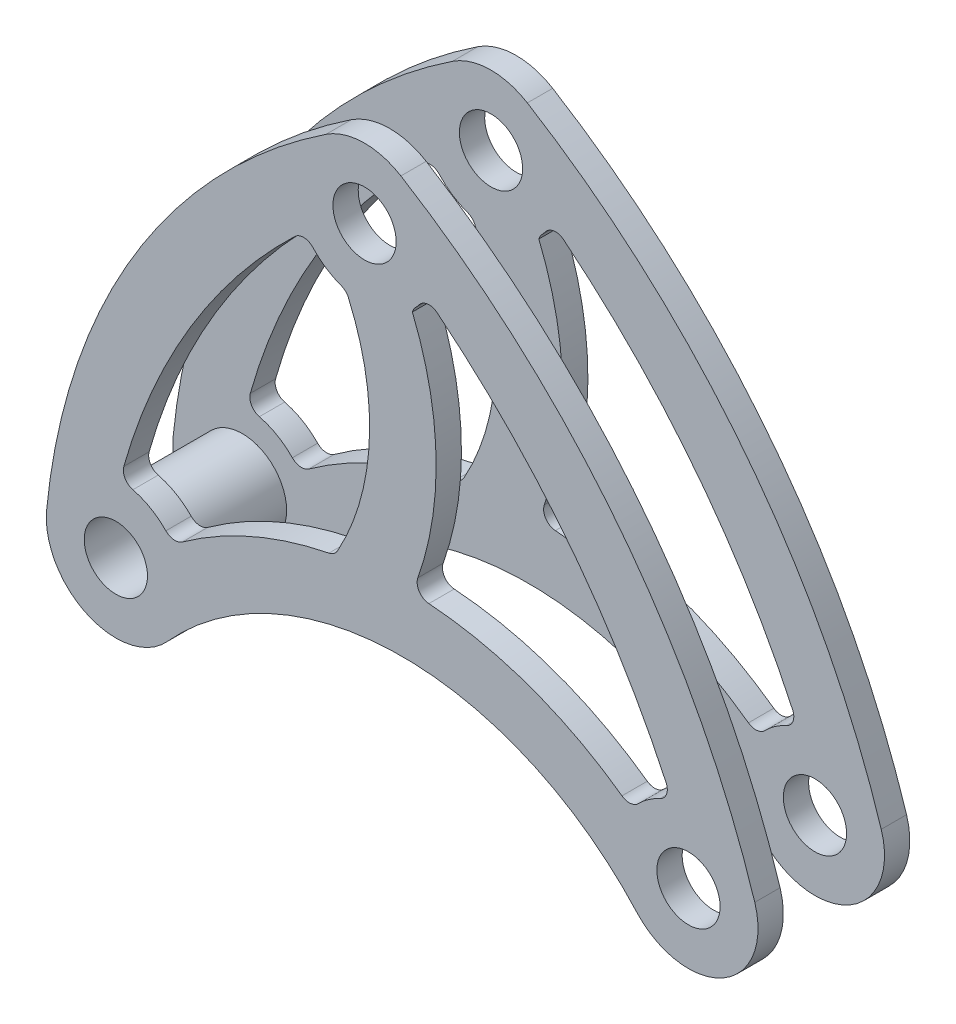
from build123d import *

# Parameters (mm, degrees)
SKETCH1_R               = 5
BOSS_EXTRUDE1_DEPTH     = 24
CUT_EXTRUDE1_DEPTH      = 130.352998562
CUT_EXTRUDE1_DEPTH_BACK = 130.352998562
SKETCH2_W               = 16
SKETCH2_H               = 87.444723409
SKETCH3_R               = 7
SKETCH3_R_2             = 5
BOSS_EXTRUDE2_DEPTH     = 18


with BuildPart() as part:
    # Sketch1 → Boss-Extrude1 (new body)
    with BuildSketch(Plane.XY):
        with BuildLine():
            ThreePointArc((33.235824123, 74.606839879), (2.85848402, 42.818679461), (-10.947498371, 1.07344279))
            ThreePointArc((-10.947498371, 1.07344279), (-4.446013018, -10.061459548), (8.164344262, -7.371803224))
            ThreePointArc((8.164344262, -7.371803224), (45.275, 9.120000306), (82.385655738, -7.371803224))
            ThreePointArc((82.385655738, -7.371803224), (96.024491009, -9.540961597), (101.034303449, 3.328570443))
            ThreePointArc((101.034303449, 3.328570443), (79.497539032, 44.119950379), (45.072206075, 74.822806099))
            ThreePointArc((45.072206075, 74.822806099), (39.122484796, 76.442892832), (33.235824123, 74.606839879))
        make_face()
        Circle(SKETCH1_R, mode=Mode.SUBTRACT)
        with Locations((90.55, 0)):
            Circle(SKETCH1_R, mode=Mode.SUBTRACT)
        with BuildLine():
            ThreePointArc((35.61737321, 55.087737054), (36.308374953, 54.666624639), (36.775955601, 54.006179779))
            ThreePointArc((36.775955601, 54.006179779), (40.081614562, 36.034671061), (35.049543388, 18.468203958))
            ThreePointArc((35.049543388, 18.468203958), (34.47958595, 17.825910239), (33.692819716, 17.48182944))
            ThreePointArc((33.692819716, 17.48182944), (21.563561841, 13.691217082), (10.515895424, 7.411352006))
            ThreePointArc((10.515895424, 7.411352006), (9.169216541, 7.042554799), (7.909441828, 7.644653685))
            ThreePointArc((7.909441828, 7.644653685), (5.513482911, 9.518482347), (2.695954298, 10.664512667))
            ThreePointArc((2.695954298, 10.664512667), (1.454382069, 11.602986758), (1.261483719, 13.147339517))
            ThreePointArc((1.261483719, 13.147339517), (11.776958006, 37.459919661), (28.306975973, 58.158597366))
            ThreePointArc((28.306975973, 58.158597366), (29.761118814, 58.713307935), (31.172625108, 58.057651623))
            ThreePointArc((31.172625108, 58.057651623), (33.211843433, 56.298585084), (35.61737321, 55.087737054))
        make_face(mode=Mode.SUBTRACT)
        with Locations((39.323157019, 65.444723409)):
            Circle(SKETCH1_R, mode=Mode.SUBTRACT)
        with BuildLine():
            ThreePointArc((87.015395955, 12.69422282), (87.077682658, 11.153441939), (86.025308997, 10.026323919))
            ThreePointArc((86.025308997, 10.026323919), (84.219912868, 8.996110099), (82.640558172, 7.644653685))
            ThreePointArc((82.640558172, 7.644653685), (81.380783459, 7.042554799), (80.034104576, 7.411352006))
            ThreePointArc((80.034104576, 7.411352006), (65.536486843, 15.063920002), (49.500806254, 18.469748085))
            ThreePointArc((49.500806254, 18.469748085), (47.969808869, 19.368826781), (47.757291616, 21.13153263))
            ThreePointArc((47.757291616, 21.13153263), (50.633321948, 39.19507409), (46.88880329, 57.098751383))
            ThreePointArc((46.88880329, 57.098751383), (47.07186657, 57.542030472), (47.355196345, 57.92898364))
            ThreePointArc((47.355196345, 57.92898364), (47.669972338, 58.280180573), (47.969405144, 58.644547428))
            ThreePointArc((47.969405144, 58.644547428), (49.316272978, 59.395435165), (50.79700225, 58.964939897))
            ThreePointArc((50.79700225, 58.964939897), (71.554762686, 37.902743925), (87.015395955, 12.69422282))
        make_face(mode=Mode.SUBTRACT)
    extrude(amount=BOSS_EXTRUDE1_DEPTH)

    # Sketch2 → Cut-Extrude1 (cut, two sides: drawn at the far end of the back side and taken through both)
    with BuildSketch(Plane(origin=(0, 0, 0), x_dir=(0, 0, -1), z_dir=(1, 0, 0)).offset(-CUT_EXTRUDE1_DEPTH_BACK)):
        with Locations((-12, 32.722361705)):
            Rectangle(SKETCH2_W, SKETCH2_H)
    extrude(amount=CUT_EXTRUDE1_DEPTH + CUT_EXTRUDE1_DEPTH_BACK, mode=Mode.SUBTRACT)


with BuildPart() as cut_extrude1_piece_1:
    # of the separate pieces the step leaves, piece 1, a body of its own (cut_extrude1_pieces)
    add(part.part.solids().sort_by_distance((45.072206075, 74.822806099, 20))[0])



with BuildPart() as cut_extrude1_piece_2:
    # of the separate pieces the step leaves, piece 2, a body of its own (cut_extrude1_pieces)
    add(part.part.solids().sort_by_distance((45.072206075, 74.822806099, 0))[0])


with BuildPart() as cut_extrude1_piece_1_1:
    add(cut_extrude1_piece_1.part)

    add(cut_extrude1_piece_2.part)  # Boss-Extrude2 merges Cut-Extrude1 piece 2
    # Sketch3 → Boss-Extrude2 (add)
    with BuildSketch(Plane.XY.offset(4)):
        with Locations(Location((0, 0, 0), (0, 0, 270))):
            Circle(SKETCH3_R)
        Circle(SKETCH3_R_2, mode=Mode.SUBTRACT)
    extrude(amount=BOSS_EXTRUDE2_DEPTH)


solid = cut_extrude1_piece_1_1.part
